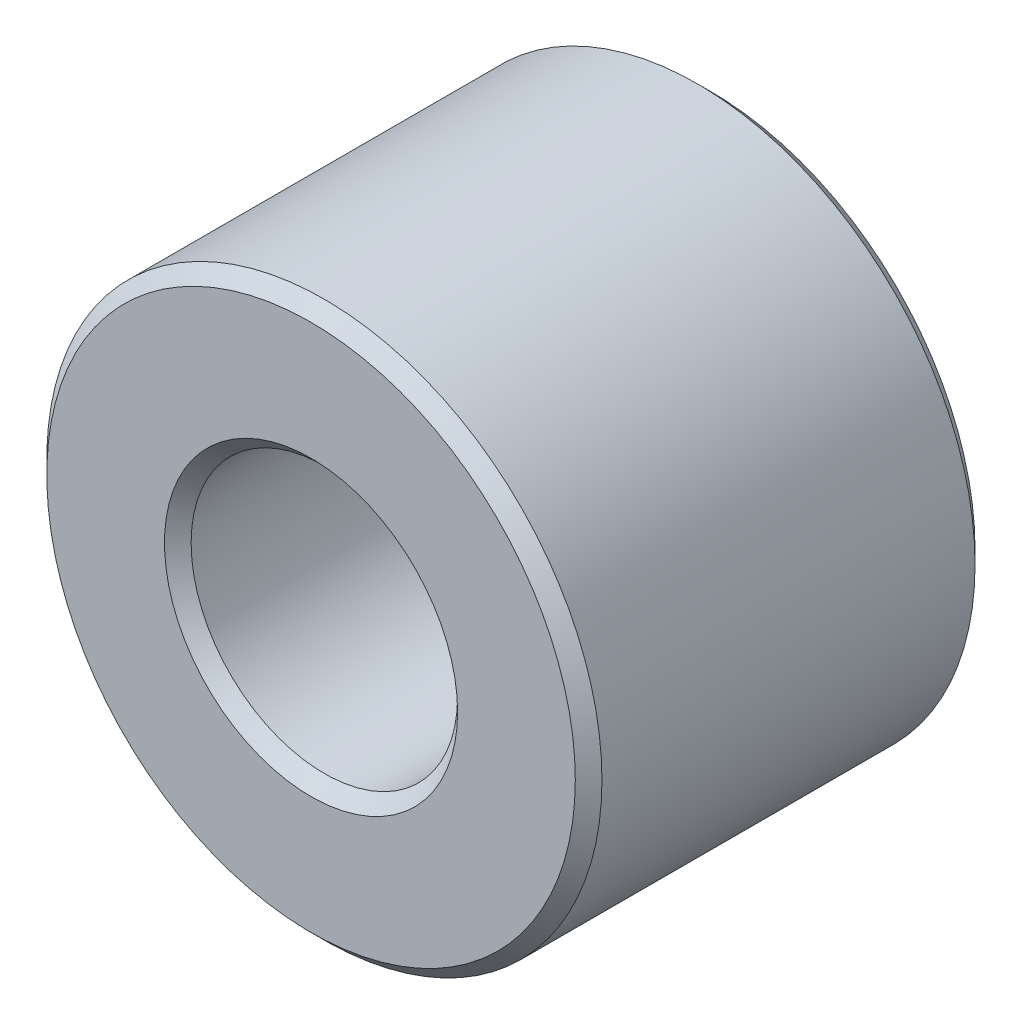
from build123d import *

# Parameters (mm, degrees)
SKETCH1_R           = 25
SKETCH1_R_2         = 12
BOSS_EXTRUDE1_DEPTH = 18
CHAMFER1_SIZE       = 1.2


with BuildPart() as part:
    # Sketch1 → Boss-Extrude1 (new, symmetric)
    with BuildSketch(Plane.XY):
        Circle(SKETCH1_R)
        Circle(SKETCH1_R_2, mode=Mode.SUBTRACT)
    extrude(amount=BOSS_EXTRUDE1_DEPTH, both=True)

    # Chamfer1
    chamfer1_edges = [part.edges().sort_by_distance(p)[0] for p in [
        (-25, 0, -18),
        (-25, 0, 18),
        (-12, 0, -18),
        (-12, 0, 18),
    ]]
    chamfer(chamfer1_edges, length=CHAMFER1_SIZE)


solid = part.part
